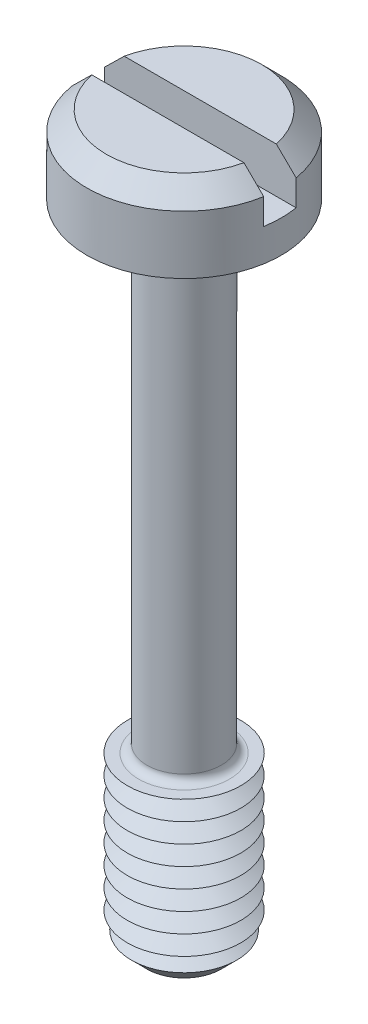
ISO-10303-21;
HEADER;
FILE_DESCRIPTION(('STEP AP214'),'2;1');
FILE_NAME('part.step','',(''),(''),'','','');
FILE_SCHEMA(('AUTOMOTIVE_DESIGN { 1 0 10303 214 1 1 1 1 }'));
ENDSEC;
DATA;
#1=APPLICATION_CONTEXT('core data for automotive mechanical design processes');
#2=APPLICATION_PROTOCOL_DEFINITION('international standard','automotive_design',2000,#1);
#3=PRODUCT_CONTEXT('',#1,'mechanical');
#4=PRODUCT('Part','Part','',(#3));
#5=PRODUCT_RELATED_PRODUCT_CATEGORY('part','',(#4));
#6=PRODUCT_DEFINITION_FORMATION('','',#4);
#7=PRODUCT_DEFINITION_CONTEXT('part definition',#1,'design');
#8=PRODUCT_DEFINITION('design','',#6,#7);
#9=PRODUCT_DEFINITION_SHAPE('','',#8);
#10=(LENGTH_UNIT() NAMED_UNIT(*) SI_UNIT(.MILLI.,.METRE.));
#11=(NAMED_UNIT(*) PLANE_ANGLE_UNIT() SI_UNIT($,.RADIAN.));
#12=(NAMED_UNIT(*) SI_UNIT($,.STERADIAN.) SOLID_ANGLE_UNIT());
#13=UNCERTAINTY_MEASURE_WITH_UNIT(LENGTH_MEASURE(1.E-05),#10,'distance_accuracy_value','');
#14=(GEOMETRIC_REPRESENTATION_CONTEXT(3) GLOBAL_UNCERTAINTY_ASSIGNED_CONTEXT((#13)) GLOBAL_UNIT_ASSIGNED_CONTEXT((#10,
#11,#12)) REPRESENTATION_CONTEXT('',''));
#15=CARTESIAN_POINT('',(0.,0.,0.));
#16=DIRECTION('',(0.,0.,1.));
#17=DIRECTION('',(1.,0.,0.));
#18=AXIS2_PLACEMENT_3D('',#15,#16,#17);
#19=CARTESIAN_POINT('',(0.,2.4,0.));
#20=DIRECTION('',(0.,1.,0.));
#21=DIRECTION('',(0.,0.,1.));
#22=AXIS2_PLACEMENT_3D('',#19,#20,#21);
#23=PLANE('',#22);
#24=DIRECTION('',(-1.,0.,0.));
#25=VECTOR('',#24,1.);
#26=CARTESIAN_POINT('',(3.,2.4,-0.5));
#27=LINE('',#26,#25);
#28=CARTESIAN_POINT('',(2.3473389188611,2.4,-0.5));
#29=VERTEX_POINT('',#28);
#30=CARTESIAN_POINT('',(-2.3473389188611,2.4,-0.5));
#31=VERTEX_POINT('',#30);
#32=EDGE_CURVE('E110',#29,#31,#27,.T.);
#33=ORIENTED_EDGE('',*,*,#32,.F.);
#34=CARTESIAN_POINT('',(0.,2.4,0.));
#35=DIRECTION('',(0.,1.,0.));
#36=DIRECTION('',(0.,0.,1.));
#37=AXIS2_PLACEMENT_3D('',#34,#35,#36);
#38=CIRCLE('',#37,2.4);
#39=EDGE_CURVE('E113',#29,#31,#38,.T.);
#40=ORIENTED_EDGE('',*,*,#39,.T.);
#41=EDGE_LOOP('',(#33,#40));
#42=FACE_BOUND('',#41,.T.);
#43=ADVANCED_FACE('F39',(#42),#23,.T.);
#44=CARTESIAN_POINT('',(0.,2.4,0.));
#45=DIRECTION('',(0.,-1.,0.));
#46=DIRECTION('',(0.,0.,-1.));
#47=AXIS2_PLACEMENT_3D('',#44,#45,#46);
#48=CONICAL_SURFACE('',#47,2.4,0.785398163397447);
#49=CARTESIAN_POINT('',(6.5992407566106,-1.81815522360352,-0.5));
#50=CARTESIAN_POINT('',(6.36552831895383,-1.58511655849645,-0.5));
#51=CARTESIAN_POINT('',(6.13178603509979,-1.35210779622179,-0.5));
#52=CARTESIAN_POINT('',(5.66419282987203,-0.886182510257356,-0.5));
#53=CARTESIAN_POINT('',(5.43034190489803,-0.653265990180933,-0.5));
#54=CARTESIAN_POINT('',(4.96229492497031,-0.187370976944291,-0.5));
#55=CARTESIAN_POINT('',(4.72809874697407,0.0456073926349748,-0.5));
#56=CARTESIAN_POINT('',(4.25949632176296,0.511336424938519,-0.5));
#57=CARTESIAN_POINT('',(4.02509008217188,0.744087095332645,-0.5));
#58=CARTESIAN_POINT('',(3.56605462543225,1.19918528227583,-0.5));
#59=CARTESIAN_POINT('',(3.34144041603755,1.42154792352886,-0.5));
#60=CARTESIAN_POINT('',(3.00406693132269,1.75465797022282,-0.5));
#61=CARTESIAN_POINT('',(2.89152775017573,1.8656282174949,-0.5));
#62=CARTESIAN_POINT('',(2.66624137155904,2.08735508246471,-0.5));
#63=CARTESIAN_POINT('',(2.5534941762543,2.19811170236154,-0.5));
#64=CARTESIAN_POINT('',(2.32775708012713,2.41925708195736,-0.5));
#65=CARTESIAN_POINT('',(2.21476734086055,2.52964600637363,-0.5));
#66=CARTESIAN_POINT('',(1.98831594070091,2.74994787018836,-0.5));
#67=CARTESIAN_POINT('',(1.87485426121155,2.85986079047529,-0.5));
#68=CARTESIAN_POINT('',(1.64719242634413,3.07888083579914,-0.5));
#69=CARTESIAN_POINT('',(1.53299241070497,3.18798810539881,-0.5));
#70=CARTESIAN_POINT('',(1.36063752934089,3.35052419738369,-0.5));
#71=CARTESIAN_POINT('',(1.3030119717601,3.40451369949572,-0.5));
#72=CARTESIAN_POINT('',(1.18725070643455,3.51194233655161,-0.5));
#73=CARTESIAN_POINT('',(1.12911501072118,3.56538148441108,-0.5));
#74=CARTESIAN_POINT('',(1.03810444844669,3.64783932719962,-0.5));
#75=CARTESIAN_POINT('',(1.00549358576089,3.67714917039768,-0.5));
#76=CARTESIAN_POINT('',(0.939964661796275,3.73543047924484,-0.5));
#77=CARTESIAN_POINT('',(0.90704657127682,3.76440191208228,-0.5));
#78=CARTESIAN_POINT('',(0.840581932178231,3.82209234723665,-0.5));
#79=CARTESIAN_POINT('',(0.807032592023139,3.85080814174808,-0.5));
#80=CARTESIAN_POINT('',(0.73940637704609,3.90759649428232,-0.5));
#81=CARTESIAN_POINT('',(0.7053296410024,3.93566921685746,-0.5));
#82=CARTESIAN_POINT('',(0.636165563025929,3.9911274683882,-0.5));
#83=CARTESIAN_POINT('',(0.601072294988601,4.01850564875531,-0.5));
#84=CARTESIAN_POINT('',(0.529844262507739,4.0718678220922,-0.5));
#85=CARTESIAN_POINT('',(0.493709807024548,4.09785222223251,-0.5));
#86=CARTESIAN_POINT('',(0.420142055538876,4.14747983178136,-0.5));
#87=CARTESIAN_POINT('',(0.382717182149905,4.17113535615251,-0.5));
#88=CARTESIAN_POINT('',(0.305809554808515,4.21475217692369,-0.5));
#89=CARTESIAN_POINT('',(0.266332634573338,4.234723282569,-0.5));
#90=CARTESIAN_POINT('',(0.194863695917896,4.26409059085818,-0.5));
#91=CARTESIAN_POINT('',(0.163467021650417,4.27488228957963,-0.5));
#92=CARTESIAN_POINT('',(0.0993951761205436,4.29114651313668,-0.5));
#93=CARTESIAN_POINT('',(0.0667267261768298,4.29664386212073,-0.5));
#94=CARTESIAN_POINT('',(0.000596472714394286,4.30109247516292,-0.5));
#95=CARTESIAN_POINT('',(-0.0328699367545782,4.29998037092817,-0.5));
#96=CARTESIAN_POINT('',(-0.0990204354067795,4.2913596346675,-0.5));
#97=CARTESIAN_POINT('',(-0.131701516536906,4.28382951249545,-0.5));
#98=CARTESIAN_POINT('',(-0.187595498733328,4.2664576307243,-0.5));
#99=CARTESIAN_POINT('',(-0.211151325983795,4.25764794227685,-0.5));
#100=CARTESIAN_POINT('',(-0.257419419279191,4.23801581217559,-0.5));
#101=CARTESIAN_POINT('',(-0.280131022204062,4.22719182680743,-0.5));
#102=CARTESIAN_POINT('',(-0.324887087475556,4.20402808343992,-0.5));
#103=CARTESIAN_POINT('',(-0.346927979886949,4.19168154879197,-0.5));
#104=CARTESIAN_POINT('',(-0.390350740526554,4.16590953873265,-0.5));
#105=CARTESIAN_POINT('',(-0.411732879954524,4.15248451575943,-0.5));
#106=CARTESIAN_POINT('',(-0.483200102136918,4.10572719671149,-0.5));
#107=CARTESIAN_POINT('',(-0.532069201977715,4.07054939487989,-0.5));
#108=CARTESIAN_POINT('',(-0.628034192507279,3.99783710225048,-0.5));
#109=CARTESIAN_POINT('',(-0.67512837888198,3.9603004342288,-0.5));
#110=CARTESIAN_POINT('',(-0.76827763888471,3.88373232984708,-0.5));
#111=CARTESIAN_POINT('',(-0.814329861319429,3.84469743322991,-0.5));
#112=CARTESIAN_POINT('',(-0.905640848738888,3.76575507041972,-0.5));
#113=CARTESIAN_POINT('',(-0.950899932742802,3.72584797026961,-0.5));
#114=CARTESIAN_POINT('',(-1.04097019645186,3.64535266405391,-0.5));
#115=CARTESIAN_POINT('',(-1.08578029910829,3.60476325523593,-0.5));
#116=CARTESIAN_POINT('',(-1.1750143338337,3.52315414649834,-0.5));
#117=CARTESIAN_POINT('',(-1.2194382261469,3.48213440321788,-0.5));
#118=CARTESIAN_POINT('',(-1.35214179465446,3.35874463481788,-0.5));
#119=CARTESIAN_POINT('',(-1.43999477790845,3.27591618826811,-0.5));
#120=CARTESIAN_POINT('',(-1.61421087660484,3.11033648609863,-0.5));
#121=CARTESIAN_POINT('',(-1.70058023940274,3.02759177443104,-0.5));
#122=CARTESIAN_POINT('',(-1.87288923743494,2.86165572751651,-0.5));
#123=CARTESIAN_POINT('',(-1.9588288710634,2.77846439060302,-0.5));
#124=CARTESIAN_POINT('',(-2.21622491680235,2.52844403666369,-0.5));
#125=CARTESIAN_POINT('',(-2.38725269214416,2.36117421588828,-0.5));
#126=CARTESIAN_POINT('',(-2.7288261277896,2.02593191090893,-0.5));
#127=CARTESIAN_POINT('',(-2.8993714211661,1.85795905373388,-0.5));
#128=CARTESIAN_POINT('',(-3.24010524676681,1.52165721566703,-0.5));
#129=CARTESIAN_POINT('',(-3.41029378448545,1.35332824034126,-0.5));
#130=CARTESIAN_POINT('',(-3.75003309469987,1.01685288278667,-0.5));
#131=CARTESIAN_POINT('',(-3.91958441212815,0.848707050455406,-0.5));
#132=CARTESIAN_POINT('',(-4.25853538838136,0.512261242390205,-0.5));
#133=CARTESIAN_POINT('',(-4.4279350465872,0.34396126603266,-0.5));
#134=CARTESIAN_POINT('',(-4.93592097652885,-0.161044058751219,-0.5));
#135=CARTESIAN_POINT('',(-5.2743487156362,-0.497908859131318,-0.5));
#136=CARTESIAN_POINT('',(-5.69486651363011,-0.9167696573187,-0.5));
#137=CARTESIAN_POINT('',(-5.77706453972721,-0.998657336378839,-0.5));
#138=CARTESIAN_POINT('',(-5.94145013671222,-1.16244746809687,-0.5));
#139=CARTESIAN_POINT('',(-6.02363770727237,-1.24434992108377,-0.5));
#140=CARTESIAN_POINT('',(-6.18806790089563,-1.40823159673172,-0.5));
#141=CARTESIAN_POINT('',(-6.27031051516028,-1.49021082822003,-0.5));
#142=CARTESIAN_POINT('',(-6.43478378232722,-1.65417699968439,-0.5));
#143=CARTESIAN_POINT('',(-6.51701443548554,-1.73616393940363,-0.5));
#144=CARTESIAN_POINT('',(-6.5992407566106,-1.81815522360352,-0.5));
#145=B_SPLINE_CURVE_WITH_KNOTS('',3,(#49,#50,#51,#52,#53,#54,#55,#56,#57,#58,#59,#60,#61,#62,
#63,#64,#65,#66,#67,#68,#69,#70,#71,#72,#73,#74,#75,#76,#77,#78,#79,#80,#81,#82,#83,#84,#85,#86,
#87,#88,#89,#90,#91,#92,#93,#94,#95,#96,#97,#98,#99,#100,#101,#102,#103,#104,#105,#106,#107,
#108,#109,#110,#111,#112,#113,#114,#115,#116,#117,#118,#119,#120,#121,#122,#123,#124,#125,#126,
#127,#128,#129,#130,#131,#132,#133,#134,#135,#136,#137,#138,#139,#140,#141,#142,#143,#144),
.UNSPECIFIED.,.F.,.F.,(4,2,2,2,2,2,2,2,2,2,2,2,2,2,2,2,2,2,2,2,2,2,2,2,2,2,2,2,2,2,2,2,2,2,2,2,
2,2,2,2,2,2,2,2,2,2,2,4),(0.,0.990129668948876,1.98029489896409,2.97132503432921,
3.96232055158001,4.91051293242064,5.384659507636,5.85880117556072,6.33268991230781,
6.80659750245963,7.28041788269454,7.51731276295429,7.75420207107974,7.88574051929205,
8.01729161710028,8.14976780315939,8.28220970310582,8.41571746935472,8.54918601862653,
8.68190589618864,8.81426715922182,8.91354607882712,9.01235719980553,9.1121171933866,
9.21221254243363,9.28755627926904,9.36295799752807,9.43870832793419,9.51442704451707,
9.69490147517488,9.87554500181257,10.0566343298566,10.2376490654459,10.4190258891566,
10.6004211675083,10.9626397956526,11.3214656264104,11.6802927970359,12.3979711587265,
13.1160968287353,13.8342113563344,14.5505812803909,15.2669541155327,16.6994694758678,
17.0475484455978,17.3956364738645,17.7440040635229,18.0923625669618),.UNSPECIFIED.);
#146=CARTESIAN_POINT('',(2.95803989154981,1.8,-0.5));
#147=VERTEX_POINT('',#146);
#148=EDGE_CURVE('E258',#147,#29,#145,.T.);
#149=ORIENTED_EDGE('',*,*,#148,.F.);
#150=CARTESIAN_POINT('',(0.,1.8,0.));
#151=DIRECTION('',(0.,1.,0.));
#152=DIRECTION('',(0.,0.,1.));
#153=AXIS2_PLACEMENT_3D('',#150,#151,#152);
#154=CIRCLE('',#153,3.);
#155=CARTESIAN_POINT('',(-2.95803989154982,1.8,-0.5));
#156=VERTEX_POINT('',#155);
#157=EDGE_CURVE('E126',#156,#147,#154,.F.);
#158=ORIENTED_EDGE('',*,*,#157,.F.);
#159=EDGE_CURVE('E102',#31,#156,#145,.T.);
#160=ORIENTED_EDGE('',*,*,#159,.F.);
#161=ORIENTED_EDGE('',*,*,#39,.F.);
#162=EDGE_LOOP('',(#149,#158,#160,#161));
#163=FACE_BOUND('',#162,.T.);
#164=ADVANCED_FACE('F220',(#163),#48,.T.);
#165=CARTESIAN_POINT('',(0.,-20.,0.));
#166=DIRECTION('',(0.,1.,0.));
#167=DIRECTION('',(0.,0.,1.));
#168=AXIS2_PLACEMENT_3D('',#165,#166,#167);
#169=CYLINDRICAL_SURFACE('',#168,1.15);
#170=CARTESIAN_POINT('',(0.,-14.55,0.));
#171=DIRECTION('',(0.,-1.,0.));
#172=DIRECTION('',(0.,0.,-1.));
#173=AXIS2_PLACEMENT_3D('',#170,#171,#172);
#174=CIRCLE('',#173,1.15);
#175=CARTESIAN_POINT('',(0.,-14.55,-1.15));
#176=VERTEX_POINT('',#175);
#177=EDGE_CURVE('E121',#176,#176,#174,.F.);
#178=ORIENTED_EDGE('',*,*,#177,.T.);
#179=EDGE_LOOP('',(#178));
#180=FACE_BOUND('',#179,.T.);
#181=CARTESIAN_POINT('',(0.,-0.25,0.));
#182=DIRECTION('',(0.,1.,0.));
#183=DIRECTION('',(0.,0.,1.));
#184=AXIS2_PLACEMENT_3D('',#181,#182,#183);
#185=CIRCLE('',#184,1.15);
#186=CARTESIAN_POINT('',(0.,-0.25,1.15));
#187=VERTEX_POINT('',#186);
#188=EDGE_CURVE('E366',#187,#187,#185,.F.);
#189=ORIENTED_EDGE('',*,*,#188,.T.);
#190=EDGE_LOOP('',(#189));
#191=FACE_BOUND('',#190,.T.);
#192=ADVANCED_FACE('F216',(#180,#191),#169,.T.);
#193=CARTESIAN_POINT('',(0.,2.4,0.));
#194=DIRECTION('',(0.,-1.,0.));
#195=DIRECTION('',(0.,0.,-1.));
#196=AXIS2_PLACEMENT_3D('',#193,#194,#195);
#197=CYLINDRICAL_SURFACE('',#196,3.);
#198=ORIENTED_EDGE('',*,*,#157,.T.);
#199=DIRECTION('',(0.,-1.,0.));
#200=VECTOR('',#199,1.);
#201=CARTESIAN_POINT('',(2.95803989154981,2.4,-0.5));
#202=LINE('',#201,#200);
#203=CARTESIAN_POINT('',(2.95803989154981,1.,-0.5));
#204=VERTEX_POINT('',#203);
#205=EDGE_CURVE('E64',#147,#204,#202,.T.);
#206=ORIENTED_EDGE('',*,*,#205,.T.);
#207=CARTESIAN_POINT('',(0.,1.,0.));
#208=DIRECTION('',(0.,1.,0.));
#209=DIRECTION('',(0.,0.,1.));
#210=AXIS2_PLACEMENT_3D('',#207,#208,#209);
#211=CIRCLE('',#210,3.);
#212=CARTESIAN_POINT('',(2.95803989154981,1.,0.5));
#213=VERTEX_POINT('',#212);
#214=EDGE_CURVE('E11',#213,#204,#211,.T.);
#215=ORIENTED_EDGE('',*,*,#214,.F.);
#216=DIRECTION('',(0.,-1.,0.));
#217=VECTOR('',#216,1.);
#218=CARTESIAN_POINT('',(2.95803989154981,2.4,0.5));
#219=LINE('',#218,#217);
#220=CARTESIAN_POINT('',(2.95803989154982,1.8,0.5));
#221=VERTEX_POINT('',#220);
#222=EDGE_CURVE('E276',#213,#221,#219,.F.);
#223=ORIENTED_EDGE('',*,*,#222,.T.);
#224=CARTESIAN_POINT('',(-2.95803989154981,1.8,0.5));
#225=VERTEX_POINT('',#224);
#226=EDGE_CURVE('E118',#221,#225,#154,.F.);
#227=ORIENTED_EDGE('',*,*,#226,.T.);
#228=DIRECTION('',(0.,-1.,0.));
#229=VECTOR('',#228,1.);
#230=CARTESIAN_POINT('',(-2.95803989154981,2.4,0.5));
#231=LINE('',#230,#229);
#232=CARTESIAN_POINT('',(-2.95803989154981,1.,0.5));
#233=VERTEX_POINT('',#232);
#234=EDGE_CURVE('E96',#225,#233,#231,.T.);
#235=ORIENTED_EDGE('',*,*,#234,.T.);
#236=CARTESIAN_POINT('',(-2.95803989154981,1.,-0.5));
#237=VERTEX_POINT('',#236);
#238=EDGE_CURVE('E44',#237,#233,#211,.T.);
#239=ORIENTED_EDGE('',*,*,#238,.F.);
#240=DIRECTION('',(0.,-1.,0.));
#241=VECTOR('',#240,1.);
#242=CARTESIAN_POINT('',(-2.95803989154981,2.4,-0.5));
#243=LINE('',#242,#241);
#244=EDGE_CURVE('E281',#237,#156,#243,.F.);
#245=ORIENTED_EDGE('',*,*,#244,.T.);
#246=EDGE_LOOP('',(#198,#206,#215,#223,#227,#235,#239,#245));
#247=FACE_BOUND('',#246,.T.);
#248=CARTESIAN_POINT('',(0.,0.,0.));
#249=DIRECTION('',(0.,1.,0.));
#250=DIRECTION('',(0.,0.,1.));
#251=AXIS2_PLACEMENT_3D('',#248,#249,#250);
#252=CIRCLE('',#251,3.);
#253=CARTESIAN_POINT('',(0.,0.,3.));
#254=VERTEX_POINT('',#253);
#255=EDGE_CURVE('E351',#254,#254,#252,.T.);
#256=ORIENTED_EDGE('',*,*,#255,.T.);
#257=EDGE_LOOP('',(#256));
#258=FACE_BOUND('',#257,.T.);
#259=ADVANCED_FACE('F219',(#247,#258),#197,.T.);
#260=DIRECTION('',(1.,0.,0.));
#261=VECTOR('',#260,1.);
#262=CARTESIAN_POINT('',(3.,2.4,0.5));
#263=LINE('',#262,#261);
#264=CARTESIAN_POINT('',(-2.3473389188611,2.4,0.5));
#265=VERTEX_POINT('',#264);
#266=CARTESIAN_POINT('',(2.3473389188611,2.4,0.5));
#267=VERTEX_POINT('',#266);
#268=EDGE_CURVE('E56',#265,#267,#263,.T.);
#269=ORIENTED_EDGE('',*,*,#268,.F.);
#270=EDGE_CURVE('E108',#265,#267,#38,.T.);
#271=ORIENTED_EDGE('',*,*,#270,.T.);
#272=EDGE_LOOP('',(#269,#271));
#273=FACE_BOUND('',#272,.T.);
#274=ADVANCED_FACE('F107',(#273),#23,.T.);
#275=CARTESIAN_POINT('',(0.,0.,0.));
#276=DIRECTION('',(0.,1.,0.));
#277=DIRECTION('',(0.,0.,1.));
#278=AXIS2_PLACEMENT_3D('',#275,#276,#277);
#279=PLANE('',#278);
#280=CARTESIAN_POINT('',(0.,0.,0.));
#281=DIRECTION('',(0.,1.,0.));
#282=DIRECTION('',(0.,0.,1.));
#283=AXIS2_PLACEMENT_3D('',#280,#281,#282);
#284=CIRCLE('',#283,1.4);
#285=CARTESIAN_POINT('',(0.,0.,1.4));
#286=VERTEX_POINT('',#285);
#287=EDGE_CURVE('E114',#286,#286,#284,.T.);
#288=ORIENTED_EDGE('',*,*,#287,.T.);
#289=EDGE_LOOP('',(#288));
#290=FACE_BOUND('',#289,.T.);
#291=ORIENTED_EDGE('',*,*,#255,.F.);
#292=EDGE_LOOP('',(#291));
#293=FACE_BOUND('',#292,.T.);
#294=ADVANCED_FACE('F210',(#290,#293),#279,.F.);
#295=CARTESIAN_POINT('',(0.,-14.8,0.));
#296=DIRECTION('',(0.,-1.,0.));
#297=DIRECTION('',(0.,0.,-1.));
#298=AXIS2_PLACEMENT_3D('',#295,#296,#297);
#299=PLANE('',#298);
#300=CARTESIAN_POINT('',(0.,-14.8,0.));
#301=DIRECTION('',(0.,-1.,0.));
#302=DIRECTION('',(0.,0.,-1.));
#303=AXIS2_PLACEMENT_3D('',#300,#301,#302);
#304=CIRCLE('',#303,1.4);
#305=CARTESIAN_POINT('',(0.,-14.8,-1.4));
#306=VERTEX_POINT('',#305);
#307=EDGE_CURVE('E359',#306,#306,#304,.T.);
#308=ORIENTED_EDGE('',*,*,#307,.T.);
#309=EDGE_LOOP('',(#308));
#310=FACE_BOUND('',#309,.T.);
#311=CARTESIAN_POINT('',(0.,-14.8,0.));
#312=DIRECTION('',(0.,1.,0.));
#313=DIRECTION('',(0.,0.,1.));
#314=AXIS2_PLACEMENT_3D('',#311,#312,#313);
#315=CIRCLE('',#314,1.75);
#316=CARTESIAN_POINT('',(0.,-14.8,1.75));
#317=VERTEX_POINT('',#316);
#318=EDGE_CURVE('E347',#317,#317,#315,.T.);
#319=ORIENTED_EDGE('',*,*,#318,.T.);
#320=EDGE_LOOP('',(#319));
#321=FACE_BOUND('',#320,.T.);
#322=ADVANCED_FACE('F206',(#310,#321),#299,.F.);
#323=CARTESIAN_POINT('',(0.,-15.1,0.));
#324=DIRECTION('',(0.,1.,0.));
#325=DIRECTION('',(0.,0.,1.));
#326=AXIS2_PLACEMENT_3D('',#323,#324,#325);
#327=CONICAL_SURFACE('',#326,1.23038475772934,1.0471975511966);
#328=ORIENTED_EDGE('',*,*,#318,.F.);
#329=EDGE_LOOP('',(#328));
#330=FACE_BOUND('',#329,.T.);
#331=CARTESIAN_POINT('',(0.,-15.1,0.));
#332=DIRECTION('',(0.,1.,0.));
#333=DIRECTION('',(0.,0.,1.));
#334=AXIS2_PLACEMENT_3D('',#331,#332,#333);
#335=CIRCLE('',#334,1.23038475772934);
#336=CARTESIAN_POINT('',(0.,-15.1,1.23038475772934));
#337=VERTEX_POINT('',#336);
#338=EDGE_CURVE('E343',#337,#337,#335,.T.);
#339=ORIENTED_EDGE('',*,*,#338,.T.);
#340=EDGE_LOOP('',(#339));
#341=FACE_BOUND('',#340,.T.);
#342=ADVANCED_FACE('F202',(#330,#341),#327,.T.);
#343=CARTESIAN_POINT('',(0.,-15.4,0.));
#344=DIRECTION('',(0.,-1.,0.));
#345=DIRECTION('',(0.,0.,-1.));
#346=AXIS2_PLACEMENT_3D('',#343,#344,#345);
#347=CONICAL_SURFACE('',#346,1.75,1.0471975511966);
#348=ORIENTED_EDGE('',*,*,#338,.F.);
#349=EDGE_LOOP('',(#348));
#350=FACE_BOUND('',#349,.T.);
#351=CARTESIAN_POINT('',(0.,-15.4,0.));
#352=DIRECTION('',(0.,1.,0.));
#353=DIRECTION('',(0.,0.,1.));
#354=AXIS2_PLACEMENT_3D('',#351,#352,#353);
#355=CIRCLE('',#354,1.75);
#356=CARTESIAN_POINT('',(0.,-15.4,1.75));
#357=VERTEX_POINT('',#356);
#358=EDGE_CURVE('E340',#357,#357,#355,.T.);
#359=ORIENTED_EDGE('',*,*,#358,.T.);
#360=EDGE_LOOP('',(#359));
#361=FACE_BOUND('',#360,.T.);
#362=ADVANCED_FACE('F198',(#350,#361),#347,.T.);
#363=CARTESIAN_POINT('',(0.,-15.7,0.));
#364=DIRECTION('',(0.,1.,0.));
#365=DIRECTION('',(0.,0.,1.));
#366=AXIS2_PLACEMENT_3D('',#363,#364,#365);
#367=CONICAL_SURFACE('',#366,1.23038475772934,1.0471975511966);
#368=ORIENTED_EDGE('',*,*,#358,.F.);
#369=EDGE_LOOP('',(#368));
#370=FACE_BOUND('',#369,.T.);
#371=CARTESIAN_POINT('',(0.,-15.7,0.));
#372=DIRECTION('',(0.,1.,0.));
#373=DIRECTION('',(0.,0.,1.));
#374=AXIS2_PLACEMENT_3D('',#371,#372,#373);
#375=CIRCLE('',#374,1.23038475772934);
#376=CARTESIAN_POINT('',(0.,-15.7,1.23038475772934));
#377=VERTEX_POINT('',#376);
#378=EDGE_CURVE('E336',#377,#377,#375,.T.);
#379=ORIENTED_EDGE('',*,*,#378,.T.);
#380=EDGE_LOOP('',(#379));
#381=FACE_BOUND('',#380,.T.);
#382=ADVANCED_FACE('F194',(#370,#381),#367,.T.);
#383=CARTESIAN_POINT('',(0.,-16.,0.));
#384=DIRECTION('',(0.,-1.,0.));
#385=DIRECTION('',(0.,0.,-1.));
#386=AXIS2_PLACEMENT_3D('',#383,#384,#385);
#387=CONICAL_SURFACE('',#386,1.75,1.0471975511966);
#388=ORIENTED_EDGE('',*,*,#378,.F.);
#389=EDGE_LOOP('',(#388));
#390=FACE_BOUND('',#389,.T.);
#391=CARTESIAN_POINT('',(0.,-16.,0.));
#392=DIRECTION('',(0.,1.,0.));
#393=DIRECTION('',(0.,0.,1.));
#394=AXIS2_PLACEMENT_3D('',#391,#392,#393);
#395=CIRCLE('',#394,1.75);
#396=CARTESIAN_POINT('',(0.,-16.,1.75));
#397=VERTEX_POINT('',#396);
#398=EDGE_CURVE('E332',#397,#397,#395,.T.);
#399=ORIENTED_EDGE('',*,*,#398,.T.);
#400=EDGE_LOOP('',(#399));
#401=FACE_BOUND('',#400,.T.);
#402=ADVANCED_FACE('F190',(#390,#401),#387,.T.);
#403=CARTESIAN_POINT('',(0.,-16.3,0.));
#404=DIRECTION('',(0.,1.,0.));
#405=DIRECTION('',(0.,0.,1.));
#406=AXIS2_PLACEMENT_3D('',#403,#404,#405);
#407=CONICAL_SURFACE('',#406,1.23038475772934,1.0471975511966);
#408=ORIENTED_EDGE('',*,*,#398,.F.);
#409=EDGE_LOOP('',(#408));
#410=FACE_BOUND('',#409,.T.);
#411=CARTESIAN_POINT('',(0.,-16.3,0.));
#412=DIRECTION('',(0.,1.,0.));
#413=DIRECTION('',(0.,0.,1.));
#414=AXIS2_PLACEMENT_3D('',#411,#412,#413);
#415=CIRCLE('',#414,1.23038475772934);
#416=CARTESIAN_POINT('',(0.,-16.3,1.23038475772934));
#417=VERTEX_POINT('',#416);
#418=EDGE_CURVE('E328',#417,#417,#415,.T.);
#419=ORIENTED_EDGE('',*,*,#418,.T.);
#420=EDGE_LOOP('',(#419));
#421=FACE_BOUND('',#420,.T.);
#422=ADVANCED_FACE('F186',(#410,#421),#407,.T.);
#423=CARTESIAN_POINT('',(0.,-16.6,0.));
#424=DIRECTION('',(0.,-1.,0.));
#425=DIRECTION('',(0.,0.,-1.));
#426=AXIS2_PLACEMENT_3D('',#423,#424,#425);
#427=CONICAL_SURFACE('',#426,1.75,1.0471975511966);
#428=ORIENTED_EDGE('',*,*,#418,.F.);
#429=EDGE_LOOP('',(#428));
#430=FACE_BOUND('',#429,.T.);
#431=CARTESIAN_POINT('',(0.,-16.6,0.));
#432=DIRECTION('',(0.,1.,0.));
#433=DIRECTION('',(0.,0.,1.));
#434=AXIS2_PLACEMENT_3D('',#431,#432,#433);
#435=CIRCLE('',#434,1.75);
#436=CARTESIAN_POINT('',(0.,-16.6,1.75));
#437=VERTEX_POINT('',#436);
#438=EDGE_CURVE('E325',#437,#437,#435,.T.);
#439=ORIENTED_EDGE('',*,*,#438,.T.);
#440=EDGE_LOOP('',(#439));
#441=FACE_BOUND('',#440,.T.);
#442=ADVANCED_FACE('F182',(#430,#441),#427,.T.);
#443=CARTESIAN_POINT('',(0.,-16.9,0.));
#444=DIRECTION('',(0.,1.,0.));
#445=DIRECTION('',(0.,0.,1.));
#446=AXIS2_PLACEMENT_3D('',#443,#444,#445);
#447=CONICAL_SURFACE('',#446,1.23038475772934,1.0471975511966);
#448=ORIENTED_EDGE('',*,*,#438,.F.);
#449=EDGE_LOOP('',(#448));
#450=FACE_BOUND('',#449,.T.);
#451=CARTESIAN_POINT('',(0.,-16.9,0.));
#452=DIRECTION('',(0.,1.,0.));
#453=DIRECTION('',(0.,0.,1.));
#454=AXIS2_PLACEMENT_3D('',#451,#452,#453);
#455=CIRCLE('',#454,1.23038475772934);
#456=CARTESIAN_POINT('',(0.,-16.9,1.23038475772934));
#457=VERTEX_POINT('',#456);
#458=EDGE_CURVE('E321',#457,#457,#455,.T.);
#459=ORIENTED_EDGE('',*,*,#458,.T.);
#460=EDGE_LOOP('',(#459));
#461=FACE_BOUND('',#460,.T.);
#462=ADVANCED_FACE('F178',(#450,#461),#447,.T.);
#463=CARTESIAN_POINT('',(0.,-17.2,0.));
#464=DIRECTION('',(0.,-1.,0.));
#465=DIRECTION('',(0.,0.,-1.));
#466=AXIS2_PLACEMENT_3D('',#463,#464,#465);
#467=CONICAL_SURFACE('',#466,1.75,1.0471975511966);
#468=ORIENTED_EDGE('',*,*,#458,.F.);
#469=EDGE_LOOP('',(#468));
#470=FACE_BOUND('',#469,.T.);
#471=CARTESIAN_POINT('',(0.,-17.2,0.));
#472=DIRECTION('',(0.,1.,0.));
#473=DIRECTION('',(0.,0.,1.));
#474=AXIS2_PLACEMENT_3D('',#471,#472,#473);
#475=CIRCLE('',#474,1.75);
#476=CARTESIAN_POINT('',(0.,-17.2,1.75));
#477=VERTEX_POINT('',#476);
#478=EDGE_CURVE('E317',#477,#477,#475,.T.);
#479=ORIENTED_EDGE('',*,*,#478,.T.);
#480=EDGE_LOOP('',(#479));
#481=FACE_BOUND('',#480,.T.);
#482=ADVANCED_FACE('F174',(#470,#481),#467,.T.);
#483=CARTESIAN_POINT('',(0.,-17.5,0.));
#484=DIRECTION('',(0.,1.,0.));
#485=DIRECTION('',(0.,0.,1.));
#486=AXIS2_PLACEMENT_3D('',#483,#484,#485);
#487=CONICAL_SURFACE('',#486,1.23038475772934,1.0471975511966);
#488=ORIENTED_EDGE('',*,*,#478,.F.);
#489=EDGE_LOOP('',(#488));
#490=FACE_BOUND('',#489,.T.);
#491=CARTESIAN_POINT('',(0.,-17.5,0.));
#492=DIRECTION('',(0.,1.,0.));
#493=DIRECTION('',(0.,0.,1.));
#494=AXIS2_PLACEMENT_3D('',#491,#492,#493);
#495=CIRCLE('',#494,1.23038475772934);
#496=CARTESIAN_POINT('',(0.,-17.5,1.23038475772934));
#497=VERTEX_POINT('',#496);
#498=EDGE_CURVE('E314',#497,#497,#495,.T.);
#499=ORIENTED_EDGE('',*,*,#498,.T.);
#500=EDGE_LOOP('',(#499));
#501=FACE_BOUND('',#500,.T.);
#502=ADVANCED_FACE('F170',(#490,#501),#487,.T.);
#503=CARTESIAN_POINT('',(0.,-17.8,0.));
#504=DIRECTION('',(0.,-1.,0.));
#505=DIRECTION('',(0.,0.,-1.));
#506=AXIS2_PLACEMENT_3D('',#503,#504,#505);
#507=CONICAL_SURFACE('',#506,1.75,1.0471975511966);
#508=ORIENTED_EDGE('',*,*,#498,.F.);
#509=EDGE_LOOP('',(#508));
#510=FACE_BOUND('',#509,.T.);
#511=CARTESIAN_POINT('',(0.,-17.8,0.));
#512=DIRECTION('',(0.,1.,0.));
#513=DIRECTION('',(0.,0.,1.));
#514=AXIS2_PLACEMENT_3D('',#511,#512,#513);
#515=CIRCLE('',#514,1.75);
#516=CARTESIAN_POINT('',(0.,-17.8,1.75));
#517=VERTEX_POINT('',#516);
#518=EDGE_CURVE('E310',#517,#517,#515,.T.);
#519=ORIENTED_EDGE('',*,*,#518,.T.);
#520=EDGE_LOOP('',(#519));
#521=FACE_BOUND('',#520,.T.);
#522=ADVANCED_FACE('F166',(#510,#521),#507,.T.);
#523=CARTESIAN_POINT('',(0.,-18.1,0.));
#524=DIRECTION('',(0.,1.,0.));
#525=DIRECTION('',(0.,0.,1.));
#526=AXIS2_PLACEMENT_3D('',#523,#524,#525);
#527=CONICAL_SURFACE('',#526,1.23038475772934,1.0471975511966);
#528=ORIENTED_EDGE('',*,*,#518,.F.);
#529=EDGE_LOOP('',(#528));
#530=FACE_BOUND('',#529,.T.);
#531=CARTESIAN_POINT('',(0.,-18.1,0.));
#532=DIRECTION('',(0.,1.,0.));
#533=DIRECTION('',(0.,0.,1.));
#534=AXIS2_PLACEMENT_3D('',#531,#532,#533);
#535=CIRCLE('',#534,1.23038475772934);
#536=CARTESIAN_POINT('',(0.,-18.1,1.23038475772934));
#537=VERTEX_POINT('',#536);
#538=EDGE_CURVE('E307',#537,#537,#535,.T.);
#539=ORIENTED_EDGE('',*,*,#538,.T.);
#540=EDGE_LOOP('',(#539));
#541=FACE_BOUND('',#540,.T.);
#542=ADVANCED_FACE('F162',(#530,#541),#527,.T.);
#543=CARTESIAN_POINT('',(0.,-18.4,0.));
#544=DIRECTION('',(0.,-1.,0.));
#545=DIRECTION('',(0.,0.,-1.));
#546=AXIS2_PLACEMENT_3D('',#543,#544,#545);
#547=CONICAL_SURFACE('',#546,1.75,1.0471975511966);
#548=ORIENTED_EDGE('',*,*,#538,.F.);
#549=EDGE_LOOP('',(#548));
#550=FACE_BOUND('',#549,.T.);
#551=CARTESIAN_POINT('',(0.,-18.4,0.));
#552=DIRECTION('',(0.,1.,0.));
#553=DIRECTION('',(0.,0.,1.));
#554=AXIS2_PLACEMENT_3D('',#551,#552,#553);
#555=CIRCLE('',#554,1.75);
#556=CARTESIAN_POINT('',(0.,-18.4,1.75));
#557=VERTEX_POINT('',#556);
#558=EDGE_CURVE('E303',#557,#557,#555,.T.);
#559=ORIENTED_EDGE('',*,*,#558,.T.);
#560=EDGE_LOOP('',(#559));
#561=FACE_BOUND('',#560,.T.);
#562=ADVANCED_FACE('F158',(#550,#561),#547,.T.);
#563=CARTESIAN_POINT('',(0.,-18.7,0.));
#564=DIRECTION('',(0.,1.,0.));
#565=DIRECTION('',(0.,0.,1.));
#566=AXIS2_PLACEMENT_3D('',#563,#564,#565);
#567=CONICAL_SURFACE('',#566,1.23038475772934,1.0471975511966);
#568=ORIENTED_EDGE('',*,*,#558,.F.);
#569=EDGE_LOOP('',(#568));
#570=FACE_BOUND('',#569,.T.);
#571=CARTESIAN_POINT('',(0.,-18.7,0.));
#572=DIRECTION('',(0.,1.,0.));
#573=DIRECTION('',(0.,0.,1.));
#574=AXIS2_PLACEMENT_3D('',#571,#572,#573);
#575=CIRCLE('',#574,1.23038475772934);
#576=CARTESIAN_POINT('',(0.,-18.7,1.23038475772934));
#577=VERTEX_POINT('',#576);
#578=EDGE_CURVE('E299',#577,#577,#575,.T.);
#579=ORIENTED_EDGE('',*,*,#578,.T.);
#580=EDGE_LOOP('',(#579));
#581=FACE_BOUND('',#580,.T.);
#582=ADVANCED_FACE('F154',(#570,#581),#567,.T.);
#583=CARTESIAN_POINT('',(0.,-19.,0.));
#584=DIRECTION('',(0.,-1.,0.));
#585=DIRECTION('',(0.,0.,-1.));
#586=AXIS2_PLACEMENT_3D('',#583,#584,#585);
#587=CONICAL_SURFACE('',#586,1.75,1.0471975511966);
#588=ORIENTED_EDGE('',*,*,#578,.F.);
#589=EDGE_LOOP('',(#588));
#590=FACE_BOUND('',#589,.T.);
#591=CARTESIAN_POINT('',(0.,-19.,0.));
#592=DIRECTION('',(0.,1.,0.));
#593=DIRECTION('',(0.,0.,1.));
#594=AXIS2_PLACEMENT_3D('',#591,#592,#593);
#595=CIRCLE('',#594,1.75);
#596=CARTESIAN_POINT('',(0.,-19.,1.75));
#597=VERTEX_POINT('',#596);
#598=EDGE_CURVE('E294',#597,#597,#595,.T.);
#599=ORIENTED_EDGE('',*,*,#598,.T.);
#600=EDGE_LOOP('',(#599));
#601=FACE_BOUND('',#600,.T.);
#602=ADVANCED_FACE('F150',(#590,#601),#587,.T.);
#603=CARTESIAN_POINT('',(0.,-19.3,0.));
#604=DIRECTION('',(0.,1.,0.));
#605=DIRECTION('',(0.,0.,1.));
#606=AXIS2_PLACEMENT_3D('',#603,#604,#605);
#607=CONICAL_SURFACE('',#606,1.23038475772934,1.0471975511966);
#608=ORIENTED_EDGE('',*,*,#598,.F.);
#609=EDGE_LOOP('',(#608));
#610=FACE_BOUND('',#609,.T.);
#611=CARTESIAN_POINT('',(0.,-19.3,0.));
#612=DIRECTION('',(0.,1.,0.));
#613=DIRECTION('',(0.,0.,1.));
#614=AXIS2_PLACEMENT_3D('',#611,#612,#613);
#615=CIRCLE('',#614,1.23038475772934);
#616=CARTESIAN_POINT('',(0.,-19.3,1.23038475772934));
#617=VERTEX_POINT('',#616);
#618=EDGE_CURVE('E290',#617,#617,#615,.T.);
#619=ORIENTED_EDGE('',*,*,#618,.T.);
#620=EDGE_LOOP('',(#619));
#621=FACE_BOUND('',#620,.T.);
#622=ADVANCED_FACE('F146',(#610,#621),#607,.T.);
#623=CARTESIAN_POINT('',(0.,-19.6,0.));
#624=DIRECTION('',(0.,-1.,0.));
#625=DIRECTION('',(0.,0.,-1.));
#626=AXIS2_PLACEMENT_3D('',#623,#624,#625);
#627=CONICAL_SURFACE('',#626,1.75,1.0471975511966);
#628=CARTESIAN_POINT('',(0.,-19.5267949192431,0.));
#629=DIRECTION('',(0.,-1.,0.));
#630=DIRECTION('',(0.,0.,-1.));
#631=AXIS2_PLACEMENT_3D('',#628,#629,#630);
#632=CIRCLE('',#631,1.62320508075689);
#633=CARTESIAN_POINT('',(0.,-19.5267949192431,-1.62320508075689));
#634=VERTEX_POINT('',#633);
#635=EDGE_CURVE('E298',#634,#634,#632,.F.);
#636=ORIENTED_EDGE('',*,*,#635,.T.);
#637=EDGE_LOOP('',(#636));
#638=FACE_BOUND('',#637,.T.);
#639=ORIENTED_EDGE('',*,*,#618,.F.);
#640=EDGE_LOOP('',(#639));
#641=FACE_BOUND('',#640,.T.);
#642=ADVANCED_FACE('F142',(#638,#641),#627,.T.);
#643=CARTESIAN_POINT('',(0.,-20.,0.));
#644=DIRECTION('',(0.,-1.,0.));
#645=DIRECTION('',(0.,0.,-1.));
#646=AXIS2_PLACEMENT_3D('',#643,#644,#645);
#647=PLANE('',#646);
#648=CARTESIAN_POINT('',(0.,-20.,0.));
#649=DIRECTION('',(0.,-1.,0.));
#650=DIRECTION('',(0.,0.,-1.));
#651=AXIS2_PLACEMENT_3D('',#648,#649,#650);
#652=CIRCLE('',#651,1.15);
#653=CARTESIAN_POINT('',(0.,-20.,-1.15));
#654=VERTEX_POINT('',#653);
#655=EDGE_CURVE('E355',#654,#654,#652,.T.);
#656=ORIENTED_EDGE('',*,*,#655,.T.);
#657=EDGE_LOOP('',(#656));
#658=FACE_BOUND('',#657,.T.);
#659=ADVANCED_FACE('F145',(#658),#647,.T.);
#660=CARTESIAN_POINT('',(0.,-20.,0.));
#661=DIRECTION('',(0.,1.,0.));
#662=DIRECTION('',(0.,0.,1.));
#663=AXIS2_PLACEMENT_3D('',#660,#661,#662);
#664=CONICAL_SURFACE('',#663,1.15,0.785398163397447);
#665=ORIENTED_EDGE('',*,*,#635,.F.);
#666=EDGE_LOOP('',(#665));
#667=FACE_BOUND('',#666,.T.);
#668=ORIENTED_EDGE('',*,*,#655,.F.);
#669=EDGE_LOOP('',(#668));
#670=FACE_BOUND('',#669,.T.);
#671=ADVANCED_FACE('F214',(#667,#670),#664,.T.);
#672=CARTESIAN_POINT('',(0.,-14.55,0.));
#673=DIRECTION('',(0.,-1.,0.));
#674=DIRECTION('',(0.,0.,-1.));
#675=AXIS2_PLACEMENT_3D('',#672,#673,#674);
#676=TOROIDAL_SURFACE('',#675,1.4,0.25);
#677=ORIENTED_EDGE('',*,*,#177,.F.);
#678=EDGE_LOOP('',(#677));
#679=FACE_BOUND('',#678,.T.);
#680=ORIENTED_EDGE('',*,*,#307,.F.);
#681=EDGE_LOOP('',(#680));
#682=FACE_BOUND('',#681,.T.);
#683=ADVANCED_FACE('F232',(#679,#682),#676,.F.);
#684=CARTESIAN_POINT('',(0.,-0.25,0.));
#685=DIRECTION('',(0.,1.,0.));
#686=DIRECTION('',(0.,0.,1.));
#687=AXIS2_PLACEMENT_3D('',#684,#685,#686);
#688=TOROIDAL_SURFACE('',#687,1.4,0.25);
#689=ORIENTED_EDGE('',*,*,#287,.F.);
#690=EDGE_LOOP('',(#689));
#691=FACE_BOUND('',#690,.T.);
#692=ORIENTED_EDGE('',*,*,#188,.F.);
#693=EDGE_LOOP('',(#692));
#694=FACE_BOUND('',#693,.T.);
#695=ADVANCED_FACE('F235',(#691,#694),#688,.F.);
#696=CARTESIAN_POINT('',(-6.5992407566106,-1.81815522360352,0.5));
#697=CARTESIAN_POINT('',(-6.36552831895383,-1.58511655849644,0.5));
#698=CARTESIAN_POINT('',(-6.13178603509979,-1.35210779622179,0.5));
#699=CARTESIAN_POINT('',(-5.66419282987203,-0.886182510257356,0.5));
#700=CARTESIAN_POINT('',(-5.43034190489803,-0.653265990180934,0.5));
#701=CARTESIAN_POINT('',(-4.96229492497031,-0.187370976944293,0.5));
#702=CARTESIAN_POINT('',(-4.72809874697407,0.0456073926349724,0.5));
#703=CARTESIAN_POINT('',(-4.25949632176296,0.511336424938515,0.5));
#704=CARTESIAN_POINT('',(-4.02509008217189,0.744087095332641,0.5));
#705=CARTESIAN_POINT('',(-3.56605462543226,1.19918528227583,0.5));
#706=CARTESIAN_POINT('',(-3.34144041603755,1.42154792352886,0.5));
#707=CARTESIAN_POINT('',(-3.0040669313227,1.75465797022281,0.5));
#708=CARTESIAN_POINT('',(-2.89152775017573,1.8656282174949,0.5));
#709=CARTESIAN_POINT('',(-2.66624137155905,2.0873550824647,0.5));
#710=CARTESIAN_POINT('',(-2.5534941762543,2.19811170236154,0.5));
#711=CARTESIAN_POINT('',(-2.32775708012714,2.41925708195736,0.5));
#712=CARTESIAN_POINT('',(-2.21476734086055,2.52964600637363,0.5));
#713=CARTESIAN_POINT('',(-1.98831594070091,2.74994787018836,0.5));
#714=CARTESIAN_POINT('',(-1.87485426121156,2.85986079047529,0.5));
#715=CARTESIAN_POINT('',(-1.64719242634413,3.07888083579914,0.5));
#716=CARTESIAN_POINT('',(-1.53299241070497,3.18798810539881,0.5));
#717=CARTESIAN_POINT('',(-1.36063752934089,3.35052419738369,0.5));
#718=CARTESIAN_POINT('',(-1.3030119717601,3.40451369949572,0.5));
#719=CARTESIAN_POINT('',(-1.18725070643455,3.51194233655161,0.5));
#720=CARTESIAN_POINT('',(-1.12911501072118,3.56538148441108,0.5));
#721=CARTESIAN_POINT('',(-1.03810444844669,3.64783932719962,0.5));
#722=CARTESIAN_POINT('',(-1.00549358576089,3.67714917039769,0.5));
#723=CARTESIAN_POINT('',(-0.939964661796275,3.73543047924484,0.5));
#724=CARTESIAN_POINT('',(-0.907046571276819,3.76440191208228,0.5));
#725=CARTESIAN_POINT('',(-0.840581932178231,3.82209234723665,0.5));
#726=CARTESIAN_POINT('',(-0.807032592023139,3.85080814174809,0.5));
#727=CARTESIAN_POINT('',(-0.73940637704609,3.90759649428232,0.5));
#728=CARTESIAN_POINT('',(-0.7053296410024,3.93566921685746,0.5));
#729=CARTESIAN_POINT('',(-0.636165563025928,3.9911274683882,0.5));
#730=CARTESIAN_POINT('',(-0.6010722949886,4.01850564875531,0.5));
#731=CARTESIAN_POINT('',(-0.529844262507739,4.0718678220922,0.5));
#732=CARTESIAN_POINT('',(-0.493709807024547,4.09785222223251,0.5));
#733=CARTESIAN_POINT('',(-0.420142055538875,4.14747983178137,0.5));
#734=CARTESIAN_POINT('',(-0.382717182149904,4.17113535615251,0.5));
#735=CARTESIAN_POINT('',(-0.305809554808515,4.21475217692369,0.5));
#736=CARTESIAN_POINT('',(-0.266332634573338,4.234723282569,0.5));
#737=CARTESIAN_POINT('',(-0.194863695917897,4.26409059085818,0.5));
#738=CARTESIAN_POINT('',(-0.163467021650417,4.27488228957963,0.5));
#739=CARTESIAN_POINT('',(-0.0993951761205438,4.29114651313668,0.5));
#740=CARTESIAN_POINT('',(-0.06672672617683,4.29664386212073,0.5));
#741=CARTESIAN_POINT('',(-0.000596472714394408,4.30109247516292,0.5));
#742=CARTESIAN_POINT('',(0.0328699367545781,4.29998037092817,0.5));
#743=CARTESIAN_POINT('',(0.0990204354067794,4.2913596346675,0.5));
#744=CARTESIAN_POINT('',(0.131701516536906,4.28382951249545,0.5));
#745=CARTESIAN_POINT('',(0.187595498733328,4.2664576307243,0.5));
#746=CARTESIAN_POINT('',(0.211151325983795,4.25764794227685,0.5));
#747=CARTESIAN_POINT('',(0.257419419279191,4.23801581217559,0.5));
#748=CARTESIAN_POINT('',(0.280131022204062,4.22719182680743,0.5));
#749=CARTESIAN_POINT('',(0.324887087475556,4.20402808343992,0.5));
#750=CARTESIAN_POINT('',(0.346927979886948,4.19168154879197,0.5));
#751=CARTESIAN_POINT('',(0.390350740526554,4.16590953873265,0.5));
#752=CARTESIAN_POINT('',(0.411732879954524,4.15248451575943,0.5));
#753=CARTESIAN_POINT('',(0.483200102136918,4.10572719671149,0.5));
#754=CARTESIAN_POINT('',(0.532069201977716,4.07054939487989,0.5));
#755=CARTESIAN_POINT('',(0.62803419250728,3.99783710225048,0.5));
#756=CARTESIAN_POINT('',(0.675128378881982,3.9603004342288,0.5));
#757=CARTESIAN_POINT('',(0.768277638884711,3.88373232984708,0.5));
#758=CARTESIAN_POINT('',(0.81432986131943,3.84469743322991,0.5));
#759=CARTESIAN_POINT('',(0.905640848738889,3.76575507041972,0.5));
#760=CARTESIAN_POINT('',(0.950899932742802,3.72584797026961,0.5));
#761=CARTESIAN_POINT('',(1.04097019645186,3.64535266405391,0.5));
#762=CARTESIAN_POINT('',(1.08578029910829,3.60476325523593,0.5));
#763=CARTESIAN_POINT('',(1.1750143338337,3.52315414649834,0.5));
#764=CARTESIAN_POINT('',(1.2194382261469,3.48213440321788,0.5));
#765=CARTESIAN_POINT('',(1.35214179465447,3.35874463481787,0.5));
#766=CARTESIAN_POINT('',(1.43999477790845,3.27591618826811,0.5));
#767=CARTESIAN_POINT('',(1.61421087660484,3.11033648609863,0.5));
#768=CARTESIAN_POINT('',(1.70058023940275,3.02759177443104,0.5));
#769=CARTESIAN_POINT('',(1.87288923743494,2.86165572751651,0.5));
#770=CARTESIAN_POINT('',(1.9588288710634,2.77846439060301,0.5));
#771=CARTESIAN_POINT('',(2.21622491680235,2.52844403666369,0.5));
#772=CARTESIAN_POINT('',(2.38725269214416,2.36117421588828,0.5));
#773=CARTESIAN_POINT('',(2.7288261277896,2.02593191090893,0.5));
#774=CARTESIAN_POINT('',(2.8993714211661,1.85795905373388,0.5));
#775=CARTESIAN_POINT('',(3.24010524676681,1.52165721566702,0.5));
#776=CARTESIAN_POINT('',(3.41029378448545,1.35332824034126,0.5));
#777=CARTESIAN_POINT('',(3.75003309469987,1.01685288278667,0.5));
#778=CARTESIAN_POINT('',(3.91958441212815,0.848707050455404,0.5));
#779=CARTESIAN_POINT('',(4.25853538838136,0.512261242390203,0.5));
#780=CARTESIAN_POINT('',(4.4279350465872,0.343961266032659,0.5));
#781=CARTESIAN_POINT('',(4.93592097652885,-0.161044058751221,0.5));
#782=CARTESIAN_POINT('',(5.2743487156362,-0.497908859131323,0.5));
#783=CARTESIAN_POINT('',(5.69486651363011,-0.916769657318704,0.5));
#784=CARTESIAN_POINT('',(5.77706453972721,-0.998657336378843,0.5));
#785=CARTESIAN_POINT('',(5.94145013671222,-1.16244746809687,0.5));
#786=CARTESIAN_POINT('',(6.02363770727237,-1.24434992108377,0.5));
#787=CARTESIAN_POINT('',(6.18806790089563,-1.40823159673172,0.5));
#788=CARTESIAN_POINT('',(6.27031051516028,-1.49021082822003,0.5));
#789=CARTESIAN_POINT('',(6.43478378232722,-1.6541769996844,0.5));
#790=CARTESIAN_POINT('',(6.51701443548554,-1.73616393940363,0.5));
#791=CARTESIAN_POINT('',(6.5992407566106,-1.81815522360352,0.5));
#792=B_SPLINE_CURVE_WITH_KNOTS('',3,(#696,#697,#698,#699,#700,#701,#702,#703,#704,#705,#706,
#707,#708,#709,#710,#711,#712,#713,#714,#715,#716,#717,#718,#719,#720,#721,#722,#723,#724,#725,
#726,#727,#728,#729,#730,#731,#732,#733,#734,#735,#736,#737,#738,#739,#740,#741,#742,#743,#744,
#745,#746,#747,#748,#749,#750,#751,#752,#753,#754,#755,#756,#757,#758,#759,#760,#761,#762,#763,
#764,#765,#766,#767,#768,#769,#770,#771,#772,#773,#774,#775,#776,#777,#778,#779,#780,#781,#782,
#783,#784,#785,#786,#787,#788,#789,#790,#791),.UNSPECIFIED.,.F.,.F.,(4,2,2,2,2,2,2,2,2,2,2,2,2,
2,2,2,2,2,2,2,2,2,2,2,2,2,2,2,2,2,2,2,2,2,2,2,2,2,2,2,2,2,2,2,2,2,2,4),(0.,0.990129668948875,
1.98029489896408,2.97132503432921,3.96232055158,4.91051293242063,5.384659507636,
5.85880117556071,6.3326899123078,6.80659750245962,7.28041788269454,7.51731276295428,
7.75420207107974,7.88574051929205,8.01729161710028,8.14976780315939,8.28220970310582,
8.41571746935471,8.54918601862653,8.68190589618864,8.81426715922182,8.91354607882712,
9.01235719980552,9.1121171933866,9.21221254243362,9.28755627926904,9.36295799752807,
9.43870832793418,9.51442704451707,9.69490147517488,9.87554500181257,10.0566343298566,
10.2376490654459,10.4190258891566,10.6004211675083,10.9626397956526,11.3214656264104,
11.6802927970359,12.3979711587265,13.1160968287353,13.8342113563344,14.5505812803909,
15.2669541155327,16.6994694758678,17.0475484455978,17.3956364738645,17.7440040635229,
18.0923625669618),.UNSPECIFIED.);
#793=EDGE_CURVE('E92',#225,#265,#792,.T.);
#794=ORIENTED_EDGE('',*,*,#793,.F.);
#795=ORIENTED_EDGE('',*,*,#226,.F.);
#796=EDGE_CURVE('E103',#267,#221,#792,.T.);
#797=ORIENTED_EDGE('',*,*,#796,.F.);
#798=ORIENTED_EDGE('',*,*,#270,.F.);
#799=EDGE_LOOP('',(#794,#795,#797,#798));
#800=FACE_BOUND('',#799,.T.);
#801=ADVANCED_FACE('F41',(#800),#48,.T.);
#802=CARTESIAN_POINT('',(0.,1.,0.));
#803=DIRECTION('',(0.,1.,0.));
#804=DIRECTION('',(0.,0.,1.));
#805=AXIS2_PLACEMENT_3D('',#802,#803,#804);
#806=PLANE('',#805);
#807=DIRECTION('',(1.,0.,0.));
#808=VECTOR('',#807,1.);
#809=CARTESIAN_POINT('',(3.,1.,0.5));
#810=LINE('',#809,#808);
#811=EDGE_CURVE('E255',#233,#213,#810,.T.);
#812=ORIENTED_EDGE('',*,*,#811,.T.);
#813=ORIENTED_EDGE('',*,*,#214,.T.);
#814=DIRECTION('',(-1.,0.,0.));
#815=VECTOR('',#814,1.);
#816=CARTESIAN_POINT('',(3.,1.,-0.5));
#817=LINE('',#816,#815);
#818=EDGE_CURVE('E273',#204,#237,#817,.T.);
#819=ORIENTED_EDGE('',*,*,#818,.T.);
#820=ORIENTED_EDGE('',*,*,#238,.T.);
#821=EDGE_LOOP('',(#812,#813,#819,#820));
#822=FACE_BOUND('',#821,.T.);
#823=ADVANCED_FACE('F242',(#822),#806,.T.);
#824=CARTESIAN_POINT('',(3.,1.,-0.5));
#825=DIRECTION('',(0.,0.,-1.));
#826=DIRECTION('',(-1.,0.,0.));
#827=AXIS2_PLACEMENT_3D('',#824,#825,#826);
#828=PLANE('',#827);
#829=ORIENTED_EDGE('',*,*,#148,.T.);
#830=ORIENTED_EDGE('',*,*,#32,.T.);
#831=ORIENTED_EDGE('',*,*,#159,.T.);
#832=ORIENTED_EDGE('',*,*,#244,.F.);
#833=ORIENTED_EDGE('',*,*,#818,.F.);
#834=ORIENTED_EDGE('',*,*,#205,.F.);
#835=EDGE_LOOP('',(#829,#830,#831,#832,#833,#834));
#836=FACE_BOUND('',#835,.T.);
#837=ADVANCED_FACE('F139',(#836),#828,.F.);
#838=CARTESIAN_POINT('',(3.,1.,0.5));
#839=DIRECTION('',(0.,0.,1.));
#840=DIRECTION('',(1.,0.,0.));
#841=AXIS2_PLACEMENT_3D('',#838,#839,#840);
#842=PLANE('',#841);
#843=ORIENTED_EDGE('',*,*,#793,.T.);
#844=ORIENTED_EDGE('',*,*,#268,.T.);
#845=ORIENTED_EDGE('',*,*,#796,.T.);
#846=ORIENTED_EDGE('',*,*,#222,.F.);
#847=ORIENTED_EDGE('',*,*,#811,.F.);
#848=ORIENTED_EDGE('',*,*,#234,.F.);
#849=EDGE_LOOP('',(#843,#844,#845,#846,#847,#848));
#850=FACE_BOUND('',#849,.T.);
#851=ADVANCED_FACE('F93',(#850),#842,.F.);
#852=CLOSED_SHELL('',(#43,#164,#192,#259,#274,#294,#322,#342,#362,#382,#402,#422,#442,#462,#482,
#502,#522,#542,#562,#582,#602,#622,#642,#659,#671,#683,#695,#801,#823,#837,#851));
#853=MANIFOLD_SOLID_BREP('B2',#852);
#854=ADVANCED_BREP_SHAPE_REPRESENTATION('',(#18,#853),#14);
#855=SHAPE_DEFINITION_REPRESENTATION(#9,#854);
ENDSEC;
END-ISO-10303-21;
